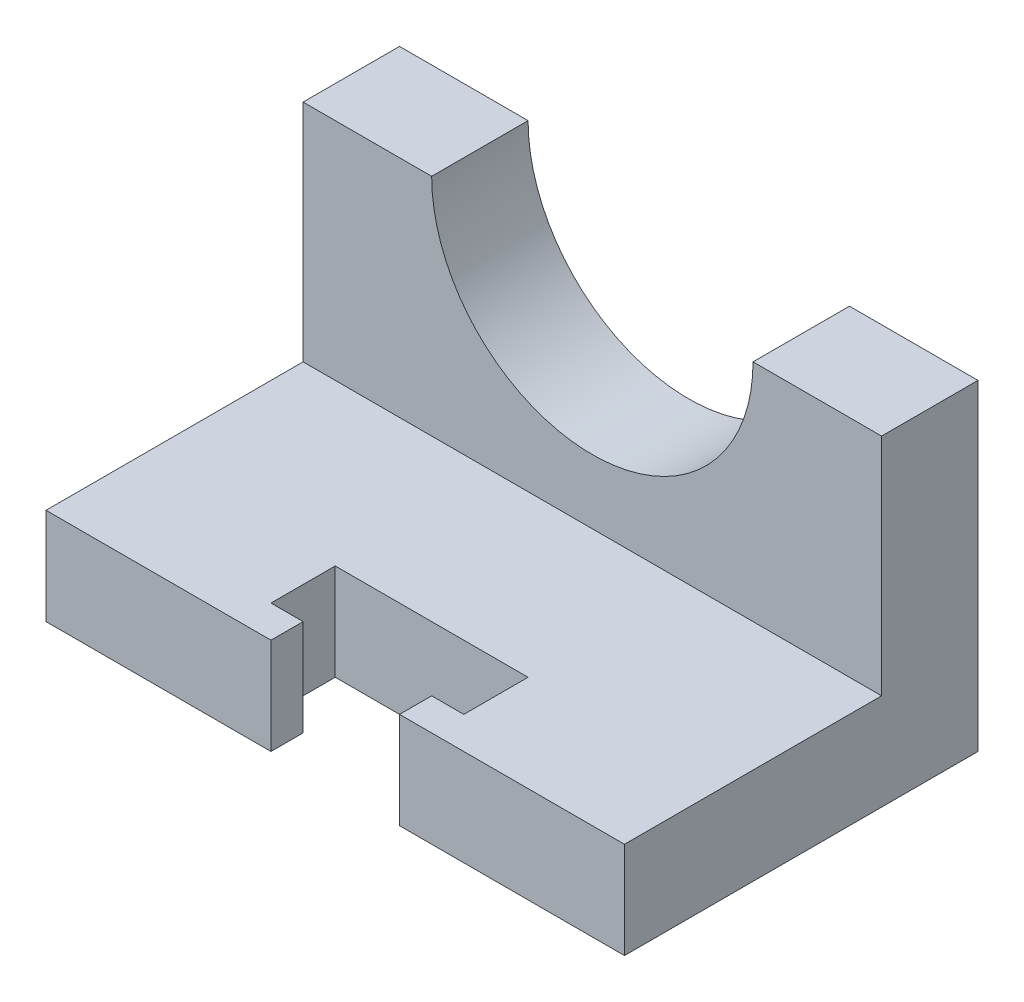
ISO-10303-21;
HEADER;
FILE_DESCRIPTION(('STEP AP214'),'2;1');
FILE_NAME('part.step','',(''),(''),'','','');
FILE_SCHEMA(('AUTOMOTIVE_DESIGN { 1 0 10303 214 1 1 1 1 }'));
ENDSEC;
DATA;
#1=APPLICATION_CONTEXT('core data for automotive mechanical design processes');
#2=APPLICATION_PROTOCOL_DEFINITION('international standard','automotive_design',2000,#1);
#3=PRODUCT_CONTEXT('',#1,'mechanical');
#4=PRODUCT('Part','Part','',(#3));
#5=PRODUCT_RELATED_PRODUCT_CATEGORY('part','',(#4));
#6=PRODUCT_DEFINITION_FORMATION('','',#4);
#7=PRODUCT_DEFINITION_CONTEXT('part definition',#1,'design');
#8=PRODUCT_DEFINITION('design','',#6,#7);
#9=PRODUCT_DEFINITION_SHAPE('','',#8);
#10=(LENGTH_UNIT() NAMED_UNIT(*) SI_UNIT(.MILLI.,.METRE.));
#11=(NAMED_UNIT(*) PLANE_ANGLE_UNIT() SI_UNIT($,.RADIAN.));
#12=(NAMED_UNIT(*) SI_UNIT($,.STERADIAN.) SOLID_ANGLE_UNIT());
#13=UNCERTAINTY_MEASURE_WITH_UNIT(LENGTH_MEASURE(1.E-05),#10,'distance_accuracy_value','');
#14=(GEOMETRIC_REPRESENTATION_CONTEXT(3) GLOBAL_UNCERTAINTY_ASSIGNED_CONTEXT((#13)) GLOBAL_UNIT_ASSIGNED_CONTEXT((#10,
#11,#12)) REPRESENTATION_CONTEXT('',''));
#15=CARTESIAN_POINT('',(0.,0.,0.));
#16=DIRECTION('',(0.,0.,1.));
#17=DIRECTION('',(1.,0.,0.));
#18=AXIS2_PLACEMENT_3D('',#15,#16,#17);
#19=CARTESIAN_POINT('',(0.,50.,0.));
#20=DIRECTION('',(0.,0.,-1.));
#21=DIRECTION('',(-1.,0.,0.));
#22=AXIS2_PLACEMENT_3D('',#19,#20,#21);
#23=PLANE('',#22);
#24=DIRECTION('',(1.,0.,0.));
#25=VECTOR('',#24,1.);
#26=CARTESIAN_POINT('',(0.,15.,0.));
#27=LINE('',#26,#25);
#28=CARTESIAN_POINT('',(55.,15.,0.));
#29=VERTEX_POINT('',#28);
#30=CARTESIAN_POINT('',(90.,15.,0.));
#31=VERTEX_POINT('',#30);
#32=EDGE_CURVE('E222',#29,#31,#27,.T.);
#33=ORIENTED_EDGE('',*,*,#32,.F.);
#34=DIRECTION('',(0.,1.,0.));
#35=VECTOR('',#34,1.);
#36=CARTESIAN_POINT('',(55.,0.,0.));
#37=LINE('',#36,#35);
#38=CARTESIAN_POINT('',(55.,0.,0.));
#39=VERTEX_POINT('',#38);
#40=EDGE_CURVE('E200',#39,#29,#37,.T.);
#41=ORIENTED_EDGE('',*,*,#40,.F.);
#42=DIRECTION('',(1.,0.,0.));
#43=VECTOR('',#42,1.);
#44=CARTESIAN_POINT('',(0.,0.,0.));
#45=LINE('',#44,#43);
#46=CARTESIAN_POINT('',(90.,0.,0.));
#47=VERTEX_POINT('',#46);
#48=EDGE_CURVE('E250',#39,#47,#45,.T.);
#49=ORIENTED_EDGE('',*,*,#48,.T.);
#50=DIRECTION('',(0.,-1.,0.));
#51=VECTOR('',#50,1.);
#52=CARTESIAN_POINT('',(90.,50.,0.));
#53=LINE('',#52,#51);
#54=EDGE_CURVE('E262',#31,#47,#53,.T.);
#55=ORIENTED_EDGE('',*,*,#54,.F.);
#56=EDGE_LOOP('',(#33,#41,#49,#55));
#57=FACE_BOUND('',#56,.T.);
#58=ADVANCED_FACE('F31',(#57),#23,.F.);
#59=CARTESIAN_POINT('',(0.,50.,-55.));
#60=DIRECTION('',(0.,-1.,0.));
#61=DIRECTION('',(0.,0.,-1.));
#62=AXIS2_PLACEMENT_3D('',#59,#60,#61);
#63=PLANE('',#62);
#64=DIRECTION('',(-1.,0.,0.));
#65=VECTOR('',#64,1.);
#66=CARTESIAN_POINT('',(0.,50.,-55.));
#67=LINE('',#66,#65);
#68=CARTESIAN_POINT('',(90.,50.,-55.));
#69=VERTEX_POINT('',#68);
#70=CARTESIAN_POINT('',(70.,50.,-55.));
#71=VERTEX_POINT('',#70);
#72=EDGE_CURVE('E244',#69,#71,#67,.T.);
#73=ORIENTED_EDGE('',*,*,#72,.T.);
#74=DIRECTION('',(0.,0.,1.));
#75=VECTOR('',#74,1.);
#76=CARTESIAN_POINT('',(70.,50.,-55.));
#77=LINE('',#76,#75);
#78=CARTESIAN_POINT('',(70.,50.,-40.));
#79=VERTEX_POINT('',#78);
#80=EDGE_CURVE('E211',#71,#79,#77,.T.);
#81=ORIENTED_EDGE('',*,*,#80,.T.);
#82=DIRECTION('',(1.,0.,0.));
#83=VECTOR('',#82,1.);
#84=CARTESIAN_POINT('',(0.,50.,-40.));
#85=LINE('',#84,#83);
#86=CARTESIAN_POINT('',(90.,50.,-40.));
#87=VERTEX_POINT('',#86);
#88=EDGE_CURVE('E231',#79,#87,#85,.T.);
#89=ORIENTED_EDGE('',*,*,#88,.T.);
#90=DIRECTION('',(0.,0.,-1.));
#91=VECTOR('',#90,1.);
#92=CARTESIAN_POINT('',(90.,50.,0.));
#93=LINE('',#92,#91);
#94=EDGE_CURVE('E240',#87,#69,#93,.T.);
#95=ORIENTED_EDGE('',*,*,#94,.T.);
#96=EDGE_LOOP('',(#73,#81,#89,#95));
#97=FACE_BOUND('',#96,.T.);
#98=ADVANCED_FACE('F317',(#97),#63,.F.);
#99=CARTESIAN_POINT('',(0.,50.,0.));
#100=DIRECTION('',(1.,0.,0.));
#101=DIRECTION('',(0.,0.,-1.));
#102=AXIS2_PLACEMENT_3D('',#99,#100,#101);
#103=PLANE('',#102);
#104=DIRECTION('',(0.,0.,-1.));
#105=VECTOR('',#104,1.);
#106=CARTESIAN_POINT('',(0.,15.,-40.));
#107=LINE('',#106,#105);
#108=CARTESIAN_POINT('',(0.,15.,0.));
#109=VERTEX_POINT('',#108);
#110=CARTESIAN_POINT('',(0.,15.,-40.));
#111=VERTEX_POINT('',#110);
#112=EDGE_CURVE('E215',#109,#111,#107,.T.);
#113=ORIENTED_EDGE('',*,*,#112,.T.);
#114=DIRECTION('',(0.,1.,0.));
#115=VECTOR('',#114,1.);
#116=CARTESIAN_POINT('',(0.,50.,-40.));
#117=LINE('',#116,#115);
#118=CARTESIAN_POINT('',(0.,50.,-40.));
#119=VERTEX_POINT('',#118);
#120=EDGE_CURVE('E218',#111,#119,#117,.T.);
#121=ORIENTED_EDGE('',*,*,#120,.T.);
#122=DIRECTION('',(0.,0.,1.));
#123=VECTOR('',#122,1.);
#124=CARTESIAN_POINT('',(0.,50.,0.));
#125=LINE('',#124,#123);
#126=CARTESIAN_POINT('',(0.,50.,-55.));
#127=VERTEX_POINT('',#126);
#128=EDGE_CURVE('E237',#127,#119,#125,.T.);
#129=ORIENTED_EDGE('',*,*,#128,.F.);
#130=DIRECTION('',(0.,-1.,0.));
#131=VECTOR('',#130,1.);
#132=CARTESIAN_POINT('',(0.,50.,-55.));
#133=LINE('',#132,#131);
#134=CARTESIAN_POINT('',(0.,0.,-55.));
#135=VERTEX_POINT('',#134);
#136=EDGE_CURVE('E247',#127,#135,#133,.T.);
#137=ORIENTED_EDGE('',*,*,#136,.T.);
#138=DIRECTION('',(0.,0.,1.));
#139=VECTOR('',#138,1.);
#140=CARTESIAN_POINT('',(0.,0.,0.));
#141=LINE('',#140,#139);
#142=CARTESIAN_POINT('',(0.,0.,0.));
#143=VERTEX_POINT('',#142);
#144=EDGE_CURVE('E230',#135,#143,#141,.T.);
#145=ORIENTED_EDGE('',*,*,#144,.T.);
#146=DIRECTION('',(0.,-1.,0.));
#147=VECTOR('',#146,1.);
#148=CARTESIAN_POINT('',(0.,50.,0.));
#149=LINE('',#148,#147);
#150=EDGE_CURVE('E39',#109,#143,#149,.T.);
#151=ORIENTED_EDGE('',*,*,#150,.F.);
#152=EDGE_LOOP('',(#113,#121,#129,#137,#145,#151));
#153=FACE_BOUND('',#152,.T.);
#154=ADVANCED_FACE('F33',(#153),#103,.F.);
#155=CARTESIAN_POINT('',(35.,0.,0.));
#156=VERTEX_POINT('',#155);
#157=EDGE_CURVE('E251',#143,#156,#45,.T.);
#158=ORIENTED_EDGE('',*,*,#157,.T.);
#159=DIRECTION('',(0.,1.,0.));
#160=VECTOR('',#159,1.);
#161=CARTESIAN_POINT('',(35.,0.,0.));
#162=LINE('',#161,#160);
#163=CARTESIAN_POINT('',(35.,15.,0.));
#164=VERTEX_POINT('',#163);
#165=EDGE_CURVE('E202',#156,#164,#162,.T.);
#166=ORIENTED_EDGE('',*,*,#165,.T.);
#167=EDGE_CURVE('E234',#109,#164,#27,.T.);
#168=ORIENTED_EDGE('',*,*,#167,.F.);
#169=ORIENTED_EDGE('',*,*,#150,.T.);
#170=EDGE_LOOP('',(#158,#166,#168,#169));
#171=FACE_BOUND('',#170,.T.);
#172=ADVANCED_FACE('F268',(#171),#23,.F.);
#173=CARTESIAN_POINT('',(90.,50.,0.));
#174=DIRECTION('',(-1.,0.,0.));
#175=DIRECTION('',(0.,0.,1.));
#176=AXIS2_PLACEMENT_3D('',#173,#174,#175);
#177=PLANE('',#176);
#178=ORIENTED_EDGE('',*,*,#94,.F.);
#179=DIRECTION('',(0.,1.,0.));
#180=VECTOR('',#179,1.);
#181=CARTESIAN_POINT('',(90.,50.,-40.));
#182=LINE('',#181,#180);
#183=CARTESIAN_POINT('',(90.,15.,-40.));
#184=VERTEX_POINT('',#183);
#185=EDGE_CURVE('E219',#184,#87,#182,.T.);
#186=ORIENTED_EDGE('',*,*,#185,.F.);
#187=DIRECTION('',(0.,0.,-1.));
#188=VECTOR('',#187,1.);
#189=CARTESIAN_POINT('',(90.,15.,-40.));
#190=LINE('',#189,#188);
#191=EDGE_CURVE('E214',#31,#184,#190,.T.);
#192=ORIENTED_EDGE('',*,*,#191,.F.);
#193=ORIENTED_EDGE('',*,*,#54,.T.);
#194=DIRECTION('',(0.,0.,-1.));
#195=VECTOR('',#194,1.);
#196=CARTESIAN_POINT('',(90.,0.,0.));
#197=LINE('',#196,#195);
#198=CARTESIAN_POINT('',(90.,0.,-55.));
#199=VERTEX_POINT('',#198);
#200=EDGE_CURVE('E254',#47,#199,#197,.T.);
#201=ORIENTED_EDGE('',*,*,#200,.T.);
#202=DIRECTION('',(0.,-1.,0.));
#203=VECTOR('',#202,1.);
#204=CARTESIAN_POINT('',(90.,50.,-55.));
#205=LINE('',#204,#203);
#206=EDGE_CURVE('E259',#69,#199,#205,.T.);
#207=ORIENTED_EDGE('',*,*,#206,.F.);
#208=EDGE_LOOP('',(#178,#186,#192,#193,#201,#207));
#209=FACE_BOUND('',#208,.T.);
#210=ADVANCED_FACE('F284',(#209),#177,.F.);
#211=CARTESIAN_POINT('',(0.,50.,-55.));
#212=DIRECTION('',(0.,0.,1.));
#213=DIRECTION('',(1.,0.,0.));
#214=AXIS2_PLACEMENT_3D('',#211,#212,#213);
#215=PLANE('',#214);
#216=CARTESIAN_POINT('',(20.,50.,-55.));
#217=VERTEX_POINT('',#216);
#218=EDGE_CURVE('E243',#217,#127,#67,.T.);
#219=ORIENTED_EDGE('',*,*,#218,.F.);
#220=CARTESIAN_POINT('',(45.,50.,-55.));
#221=DIRECTION('',(0.,0.,1.));
#222=DIRECTION('',(1.,0.,0.));
#223=AXIS2_PLACEMENT_3D('',#220,#221,#222);
#224=CIRCLE('',#223,25.);
#225=EDGE_CURVE('E195',#217,#71,#224,.T.);
#226=ORIENTED_EDGE('',*,*,#225,.T.);
#227=ORIENTED_EDGE('',*,*,#72,.F.);
#228=ORIENTED_EDGE('',*,*,#206,.T.);
#229=DIRECTION('',(-1.,0.,0.));
#230=VECTOR('',#229,1.);
#231=CARTESIAN_POINT('',(0.,0.,-55.));
#232=LINE('',#231,#230);
#233=EDGE_CURVE('E241',#199,#135,#232,.T.);
#234=ORIENTED_EDGE('',*,*,#233,.T.);
#235=ORIENTED_EDGE('',*,*,#136,.F.);
#236=EDGE_LOOP('',(#219,#226,#227,#228,#234,#235));
#237=FACE_BOUND('',#236,.T.);
#238=ADVANCED_FACE('F277',(#237),#215,.F.);
#239=CARTESIAN_POINT('',(20.,50.,-40.));
#240=VERTEX_POINT('',#239);
#241=EDGE_CURVE('E227',#119,#240,#85,.T.);
#242=ORIENTED_EDGE('',*,*,#241,.T.);
#243=DIRECTION('',(0.,0.,1.));
#244=VECTOR('',#243,1.);
#245=CARTESIAN_POINT('',(20.,50.,-55.));
#246=LINE('',#245,#244);
#247=EDGE_CURVE('E54',#240,#217,#246,.F.);
#248=ORIENTED_EDGE('',*,*,#247,.T.);
#249=ORIENTED_EDGE('',*,*,#218,.T.);
#250=ORIENTED_EDGE('',*,*,#128,.T.);
#251=EDGE_LOOP('',(#242,#248,#249,#250));
#252=FACE_BOUND('',#251,.T.);
#253=ADVANCED_FACE('F312',(#252),#63,.F.);
#254=CARTESIAN_POINT('',(0.,0.,-55.));
#255=DIRECTION('',(0.,-1.,0.));
#256=DIRECTION('',(0.,0.,-1.));
#257=AXIS2_PLACEMENT_3D('',#254,#255,#256);
#258=PLANE('',#257);
#259=DIRECTION('',(0.,0.,-1.));
#260=VECTOR('',#259,1.);
#261=CARTESIAN_POINT('',(55.,0.,0.));
#262=LINE('',#261,#260);
#263=CARTESIAN_POINT('',(55.,0.,-5.00000000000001));
#264=VERTEX_POINT('',#263);
#265=EDGE_CURVE('E175',#39,#264,#262,.T.);
#266=ORIENTED_EDGE('',*,*,#265,.T.);
#267=DIRECTION('',(1.,0.,0.));
#268=VECTOR('',#267,1.);
#269=CARTESIAN_POINT('',(55.,0.,-5.00000000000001));
#270=LINE('',#269,#268);
#271=CARTESIAN_POINT('',(60.,0.,-5.00000000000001));
#272=VERTEX_POINT('',#271);
#273=EDGE_CURVE('E177',#264,#272,#270,.T.);
#274=ORIENTED_EDGE('',*,*,#273,.T.);
#275=DIRECTION('',(0.,0.,-1.));
#276=VECTOR('',#275,1.);
#277=CARTESIAN_POINT('',(60.,0.,-5.00000000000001));
#278=LINE('',#277,#276);
#279=CARTESIAN_POINT('',(60.,0.,-15.));
#280=VERTEX_POINT('',#279);
#281=EDGE_CURVE('E151',#272,#280,#278,.T.);
#282=ORIENTED_EDGE('',*,*,#281,.T.);
#283=DIRECTION('',(-1.,0.,0.));
#284=VECTOR('',#283,1.);
#285=CARTESIAN_POINT('',(30.,0.,-15.));
#286=LINE('',#285,#284);
#287=CARTESIAN_POINT('',(30.,0.,-15.));
#288=VERTEX_POINT('',#287);
#289=EDGE_CURVE('E145',#280,#288,#286,.T.);
#290=ORIENTED_EDGE('',*,*,#289,.T.);
#291=DIRECTION('',(0.,0.,1.));
#292=VECTOR('',#291,1.);
#293=CARTESIAN_POINT('',(30.,0.,-5.00000000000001));
#294=LINE('',#293,#292);
#295=CARTESIAN_POINT('',(30.,0.,-5.00000000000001));
#296=VERTEX_POINT('',#295);
#297=EDGE_CURVE('E154',#288,#296,#294,.T.);
#298=ORIENTED_EDGE('',*,*,#297,.T.);
#299=DIRECTION('',(1.,0.,0.));
#300=VECTOR('',#299,1.);
#301=CARTESIAN_POINT('',(35.,0.,-5.00000000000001));
#302=LINE('',#301,#300);
#303=CARTESIAN_POINT('',(35.,0.,-5.00000000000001));
#304=VERTEX_POINT('',#303);
#305=EDGE_CURVE('E159',#296,#304,#302,.T.);
#306=ORIENTED_EDGE('',*,*,#305,.T.);
#307=DIRECTION('',(0.,0.,1.));
#308=VECTOR('',#307,1.);
#309=CARTESIAN_POINT('',(35.,0.,0.));
#310=LINE('',#309,#308);
#311=EDGE_CURVE('E172',#304,#156,#310,.T.);
#312=ORIENTED_EDGE('',*,*,#311,.T.);
#313=ORIENTED_EDGE('',*,*,#157,.F.);
#314=ORIENTED_EDGE('',*,*,#144,.F.);
#315=ORIENTED_EDGE('',*,*,#233,.F.);
#316=ORIENTED_EDGE('',*,*,#200,.F.);
#317=ORIENTED_EDGE('',*,*,#48,.F.);
#318=EDGE_LOOP('',(#266,#274,#282,#290,#298,#306,#312,#313,#314,#315,#316,#317));
#319=FACE_BOUND('',#318,.T.);
#320=ADVANCED_FACE('F162',(#319),#258,.T.);
#321=CARTESIAN_POINT('',(0.,50.,-40.));
#322=DIRECTION('',(0.,0.,-1.));
#323=DIRECTION('',(0.,1.,0.));
#324=AXIS2_PLACEMENT_3D('',#321,#322,#323);
#325=PLANE('',#324);
#326=ORIENTED_EDGE('',*,*,#88,.F.);
#327=CARTESIAN_POINT('',(45.,50.,-40.));
#328=DIRECTION('',(0.,0.,-1.));
#329=DIRECTION('',(0.,1.,0.));
#330=AXIS2_PLACEMENT_3D('',#327,#328,#329);
#331=CIRCLE('',#330,25.);
#332=EDGE_CURVE('E11',#79,#240,#331,.T.);
#333=ORIENTED_EDGE('',*,*,#332,.T.);
#334=ORIENTED_EDGE('',*,*,#241,.F.);
#335=ORIENTED_EDGE('',*,*,#120,.F.);
#336=DIRECTION('',(1.,0.,0.));
#337=VECTOR('',#336,1.);
#338=CARTESIAN_POINT('',(0.,15.,-40.));
#339=LINE('',#338,#337);
#340=EDGE_CURVE('E232',#111,#184,#339,.T.);
#341=ORIENTED_EDGE('',*,*,#340,.T.);
#342=ORIENTED_EDGE('',*,*,#185,.T.);
#343=EDGE_LOOP('',(#326,#333,#334,#335,#341,#342));
#344=FACE_BOUND('',#343,.T.);
#345=ADVANCED_FACE('F314',(#344),#325,.F.);
#346=CARTESIAN_POINT('',(0.,15.,-40.));
#347=DIRECTION('',(0.,-1.,0.));
#348=DIRECTION('',(0.,0.,-1.));
#349=AXIS2_PLACEMENT_3D('',#346,#347,#348);
#350=PLANE('',#349);
#351=DIRECTION('',(1.,0.,0.));
#352=VECTOR('',#351,1.);
#353=CARTESIAN_POINT('',(55.,15.,-5.00000000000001));
#354=LINE('',#353,#352);
#355=CARTESIAN_POINT('',(55.,15.,-5.00000000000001));
#356=VERTEX_POINT('',#355);
#357=CARTESIAN_POINT('',(60.,15.,-5.00000000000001));
#358=VERTEX_POINT('',#357);
#359=EDGE_CURVE('E168',#356,#358,#354,.T.);
#360=ORIENTED_EDGE('',*,*,#359,.F.);
#361=DIRECTION('',(0.,0.,-1.));
#362=VECTOR('',#361,1.);
#363=CARTESIAN_POINT('',(55.,15.,0.));
#364=LINE('',#363,#362);
#365=EDGE_CURVE('E188',#29,#356,#364,.T.);
#366=ORIENTED_EDGE('',*,*,#365,.F.);
#367=ORIENTED_EDGE('',*,*,#32,.T.);
#368=ORIENTED_EDGE('',*,*,#191,.T.);
#369=ORIENTED_EDGE('',*,*,#340,.F.);
#370=ORIENTED_EDGE('',*,*,#112,.F.);
#371=ORIENTED_EDGE('',*,*,#167,.T.);
#372=DIRECTION('',(0.,0.,1.));
#373=VECTOR('',#372,1.);
#374=CARTESIAN_POINT('',(35.,15.,0.));
#375=LINE('',#374,#373);
#376=CARTESIAN_POINT('',(35.,15.,-5.00000000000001));
#377=VERTEX_POINT('',#376);
#378=EDGE_CURVE('E186',#377,#164,#375,.T.);
#379=ORIENTED_EDGE('',*,*,#378,.F.);
#380=DIRECTION('',(1.,0.,0.));
#381=VECTOR('',#380,1.);
#382=CARTESIAN_POINT('',(35.,15.,-5.00000000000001));
#383=LINE('',#382,#381);
#384=CARTESIAN_POINT('',(30.,15.,-5.00000000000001));
#385=VERTEX_POINT('',#384);
#386=EDGE_CURVE('E183',#385,#377,#383,.T.);
#387=ORIENTED_EDGE('',*,*,#386,.F.);
#388=DIRECTION('',(0.,0.,1.));
#389=VECTOR('',#388,1.);
#390=CARTESIAN_POINT('',(30.,15.,-5.00000000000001));
#391=LINE('',#390,#389);
#392=CARTESIAN_POINT('',(30.,15.,-15.));
#393=VERTEX_POINT('',#392);
#394=EDGE_CURVE('E181',#393,#385,#391,.T.);
#395=ORIENTED_EDGE('',*,*,#394,.F.);
#396=DIRECTION('',(-1.,0.,0.));
#397=VECTOR('',#396,1.);
#398=CARTESIAN_POINT('',(30.,15.,-15.));
#399=LINE('',#398,#397);
#400=CARTESIAN_POINT('',(60.,15.,-15.));
#401=VERTEX_POINT('',#400);
#402=EDGE_CURVE('E46',#401,#393,#399,.T.);
#403=ORIENTED_EDGE('',*,*,#402,.F.);
#404=DIRECTION('',(0.,0.,-1.));
#405=VECTOR('',#404,1.);
#406=CARTESIAN_POINT('',(60.,15.,-5.00000000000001));
#407=LINE('',#406,#405);
#408=EDGE_CURVE('E165',#358,#401,#407,.T.);
#409=ORIENTED_EDGE('',*,*,#408,.F.);
#410=EDGE_LOOP('',(#360,#366,#367,#368,#369,#370,#371,#379,#387,#395,#403,#409));
#411=FACE_BOUND('',#410,.T.);
#412=ADVANCED_FACE('F296',(#411),#350,.F.);
#413=CARTESIAN_POINT('',(45.,50.,-55.));
#414=DIRECTION('',(0.,0.,1.));
#415=DIRECTION('',(1.,0.,0.));
#416=AXIS2_PLACEMENT_3D('',#413,#414,#415);
#417=CYLINDRICAL_SURFACE('',#416,25.);
#418=ORIENTED_EDGE('',*,*,#225,.F.);
#419=ORIENTED_EDGE('',*,*,#247,.F.);
#420=ORIENTED_EDGE('',*,*,#332,.F.);
#421=ORIENTED_EDGE('',*,*,#80,.F.);
#422=EDGE_LOOP('',(#418,#419,#420,#421));
#423=FACE_BOUND('',#422,.T.);
#424=ADVANCED_FACE('F315',(#423),#417,.F.);
#425=CARTESIAN_POINT('',(30.,0.,-15.));
#426=DIRECTION('',(0.,0.,-1.));
#427=DIRECTION('',(0.,1.,0.));
#428=AXIS2_PLACEMENT_3D('',#425,#426,#427);
#429=PLANE('',#428);
#430=ORIENTED_EDGE('',*,*,#402,.T.);
#431=DIRECTION('',(0.,1.,0.));
#432=VECTOR('',#431,1.);
#433=CARTESIAN_POINT('',(30.,0.,-15.));
#434=LINE('',#433,#432);
#435=EDGE_CURVE('E141',#288,#393,#434,.T.);
#436=ORIENTED_EDGE('',*,*,#435,.F.);
#437=ORIENTED_EDGE('',*,*,#289,.F.);
#438=DIRECTION('',(0.,1.,0.));
#439=VECTOR('',#438,1.);
#440=CARTESIAN_POINT('',(60.,0.,-15.));
#441=LINE('',#440,#439);
#442=EDGE_CURVE('E193',#280,#401,#441,.T.);
#443=ORIENTED_EDGE('',*,*,#442,.T.);
#444=EDGE_LOOP('',(#430,#436,#437,#443));
#445=FACE_BOUND('',#444,.T.);
#446=ADVANCED_FACE('F143',(#445),#429,.F.);
#447=CARTESIAN_POINT('',(60.,0.,-5.00000000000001));
#448=DIRECTION('',(1.,0.,0.));
#449=DIRECTION('',(0.,0.,-1.));
#450=AXIS2_PLACEMENT_3D('',#447,#448,#449);
#451=PLANE('',#450);
#452=ORIENTED_EDGE('',*,*,#408,.T.);
#453=ORIENTED_EDGE('',*,*,#442,.F.);
#454=ORIENTED_EDGE('',*,*,#281,.F.);
#455=DIRECTION('',(0.,1.,0.));
#456=VECTOR('',#455,1.);
#457=CARTESIAN_POINT('',(60.,0.,-5.00000000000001));
#458=LINE('',#457,#456);
#459=EDGE_CURVE('E196',#272,#358,#458,.T.);
#460=ORIENTED_EDGE('',*,*,#459,.T.);
#461=EDGE_LOOP('',(#452,#453,#454,#460));
#462=FACE_BOUND('',#461,.T.);
#463=ADVANCED_FACE('F302',(#462),#451,.F.);
#464=CARTESIAN_POINT('',(55.,0.,-5.00000000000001));
#465=DIRECTION('',(0.,0.,1.));
#466=DIRECTION('',(1.,0.,0.));
#467=AXIS2_PLACEMENT_3D('',#464,#465,#466);
#468=PLANE('',#467);
#469=ORIENTED_EDGE('',*,*,#359,.T.);
#470=ORIENTED_EDGE('',*,*,#459,.F.);
#471=ORIENTED_EDGE('',*,*,#273,.F.);
#472=DIRECTION('',(0.,1.,0.));
#473=VECTOR('',#472,1.);
#474=CARTESIAN_POINT('',(55.,0.,-5.00000000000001));
#475=LINE('',#474,#473);
#476=EDGE_CURVE('E198',#264,#356,#475,.T.);
#477=ORIENTED_EDGE('',*,*,#476,.T.);
#478=EDGE_LOOP('',(#469,#470,#471,#477));
#479=FACE_BOUND('',#478,.T.);
#480=ADVANCED_FACE('F299',(#479),#468,.F.);
#481=CARTESIAN_POINT('',(55.,0.,0.));
#482=DIRECTION('',(1.,0.,0.));
#483=DIRECTION('',(0.,0.,-1.));
#484=AXIS2_PLACEMENT_3D('',#481,#482,#483);
#485=PLANE('',#484);
#486=ORIENTED_EDGE('',*,*,#365,.T.);
#487=ORIENTED_EDGE('',*,*,#476,.F.);
#488=ORIENTED_EDGE('',*,*,#265,.F.);
#489=ORIENTED_EDGE('',*,*,#40,.T.);
#490=EDGE_LOOP('',(#486,#487,#488,#489));
#491=FACE_BOUND('',#490,.T.);
#492=ADVANCED_FACE('F293',(#491),#485,.F.);
#493=CARTESIAN_POINT('',(35.,0.,0.));
#494=DIRECTION('',(-1.,0.,0.));
#495=DIRECTION('',(0.,0.,1.));
#496=AXIS2_PLACEMENT_3D('',#493,#494,#495);
#497=PLANE('',#496);
#498=ORIENTED_EDGE('',*,*,#378,.T.);
#499=ORIENTED_EDGE('',*,*,#165,.F.);
#500=ORIENTED_EDGE('',*,*,#311,.F.);
#501=DIRECTION('',(0.,1.,0.));
#502=VECTOR('',#501,1.);
#503=CARTESIAN_POINT('',(35.,0.,-5.00000000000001));
#504=LINE('',#503,#502);
#505=EDGE_CURVE('E205',#304,#377,#504,.T.);
#506=ORIENTED_EDGE('',*,*,#505,.T.);
#507=EDGE_LOOP('',(#498,#499,#500,#506));
#508=FACE_BOUND('',#507,.T.);
#509=ADVANCED_FACE('F308',(#508),#497,.F.);
#510=CARTESIAN_POINT('',(35.,0.,-5.00000000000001));
#511=DIRECTION('',(0.,0.,1.));
#512=DIRECTION('',(1.,0.,0.));
#513=AXIS2_PLACEMENT_3D('',#510,#511,#512);
#514=PLANE('',#513);
#515=ORIENTED_EDGE('',*,*,#386,.T.);
#516=ORIENTED_EDGE('',*,*,#505,.F.);
#517=ORIENTED_EDGE('',*,*,#305,.F.);
#518=DIRECTION('',(0.,1.,0.));
#519=VECTOR('',#518,1.);
#520=CARTESIAN_POINT('',(30.,0.,-5.00000000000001));
#521=LINE('',#520,#519);
#522=EDGE_CURVE('E150',#296,#385,#521,.T.);
#523=ORIENTED_EDGE('',*,*,#522,.T.);
#524=EDGE_LOOP('',(#515,#516,#517,#523));
#525=FACE_BOUND('',#524,.T.);
#526=ADVANCED_FACE('F306',(#525),#514,.F.);
#527=CARTESIAN_POINT('',(30.,0.,-5.00000000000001));
#528=DIRECTION('',(-1.,0.,0.));
#529=DIRECTION('',(0.,0.,1.));
#530=AXIS2_PLACEMENT_3D('',#527,#528,#529);
#531=PLANE('',#530);
#532=ORIENTED_EDGE('',*,*,#394,.T.);
#533=ORIENTED_EDGE('',*,*,#522,.F.);
#534=ORIENTED_EDGE('',*,*,#297,.F.);
#535=ORIENTED_EDGE('',*,*,#435,.T.);
#536=EDGE_LOOP('',(#532,#533,#534,#535));
#537=FACE_BOUND('',#536,.T.);
#538=ADVANCED_FACE('F155',(#537),#531,.F.);
#539=CLOSED_SHELL('',(#58,#98,#154,#172,#210,#238,#253,#320,#345,#412,#424,#446,#463,#480,#492,
#509,#526,#538));
#540=MANIFOLD_SOLID_BREP('B2',#539);
#541=ADVANCED_BREP_SHAPE_REPRESENTATION('',(#18,#540),#14);
#542=SHAPE_DEFINITION_REPRESENTATION(#9,#541);
ENDSEC;
END-ISO-10303-21;
